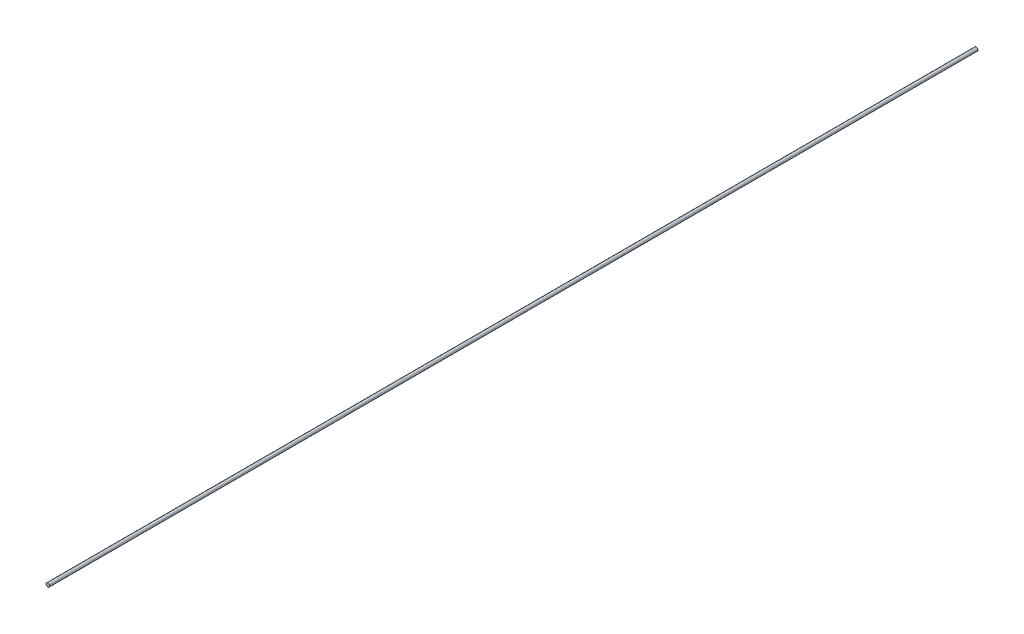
ISO-10303-21;
HEADER;
FILE_DESCRIPTION(('STEP AP214'),'2;1');
FILE_NAME('part.step','',(''),(''),'','','');
FILE_SCHEMA(('AUTOMOTIVE_DESIGN { 1 0 10303 214 1 1 1 1 }'));
ENDSEC;
DATA;
#1=APPLICATION_CONTEXT('core data for automotive mechanical design processes');
#2=APPLICATION_PROTOCOL_DEFINITION('international standard','automotive_design',2000,#1);
#3=PRODUCT_CONTEXT('',#1,'mechanical');
#4=PRODUCT('Part','Part','',(#3));
#5=PRODUCT_RELATED_PRODUCT_CATEGORY('part','',(#4));
#6=PRODUCT_DEFINITION_FORMATION('','',#4);
#7=PRODUCT_DEFINITION_CONTEXT('part definition',#1,'design');
#8=PRODUCT_DEFINITION('design','',#6,#7);
#9=PRODUCT_DEFINITION_SHAPE('','',#8);
#10=(LENGTH_UNIT() NAMED_UNIT(*) SI_UNIT(.MILLI.,.METRE.));
#11=(NAMED_UNIT(*) PLANE_ANGLE_UNIT() SI_UNIT($,.RADIAN.));
#12=(NAMED_UNIT(*) SI_UNIT($,.STERADIAN.) SOLID_ANGLE_UNIT());
#13=UNCERTAINTY_MEASURE_WITH_UNIT(LENGTH_MEASURE(1.E-05),#10,'distance_accuracy_value','');
#14=(GEOMETRIC_REPRESENTATION_CONTEXT(3) GLOBAL_UNCERTAINTY_ASSIGNED_CONTEXT((#13)) GLOBAL_UNIT_ASSIGNED_CONTEXT((#10,
#11,#12)) REPRESENTATION_CONTEXT('',''));
#15=CARTESIAN_POINT('',(0.,0.,0.));
#16=DIRECTION('',(0.,0.,1.));
#17=DIRECTION('',(1.,0.,0.));
#18=AXIS2_PLACEMENT_3D('',#15,#16,#17);
#19=CARTESIAN_POINT('',(0.,0.,0.));
#20=DIRECTION('',(0.,0.,1.));
#21=DIRECTION('',(1.,0.,0.));
#22=AXIS2_PLACEMENT_3D('',#19,#20,#21);
#23=PLANE('',#22);
#24=CARTESIAN_POINT('',(0.,0.,0.));
#25=DIRECTION('',(0.,0.,1.));
#26=DIRECTION('',(1.,0.,0.));
#27=AXIS2_PLACEMENT_3D('',#24,#25,#26);
#28=CIRCLE('',#27,5.);
#29=CARTESIAN_POINT('',(5.,0.,0.));
#30=VERTEX_POINT('',#29);
#31=EDGE_CURVE('E44',#30,#30,#28,.T.);
#32=ORIENTED_EDGE('',*,*,#31,.F.);
#33=EDGE_LOOP('',(#32));
#34=FACE_BOUND('',#33,.T.);
#35=ADVANCED_FACE('F37',(#34),#23,.F.);
#36=CARTESIAN_POINT('',(0.,-3.19087846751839E-13,2605.55));
#37=DIRECTION('',(0.,0.,1.));
#38=DIRECTION('',(1.,0.,0.));
#39=AXIS2_PLACEMENT_3D('',#36,#37,#38);
#40=PLANE('',#39);
#41=CARTESIAN_POINT('',(0.,-3.19087846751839E-13,2605.55));
#42=DIRECTION('',(0.,0.,1.));
#43=DIRECTION('',(1.,0.,0.));
#44=AXIS2_PLACEMENT_3D('',#41,#42,#43);
#45=CIRCLE('',#44,5.);
#46=CARTESIAN_POINT('',(5.,-3.19087846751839E-13,2605.55));
#47=VERTEX_POINT('',#46);
#48=EDGE_CURVE('E10',#47,#47,#45,.T.);
#49=ORIENTED_EDGE('',*,*,#48,.T.);
#50=EDGE_LOOP('',(#49));
#51=FACE_BOUND('',#50,.T.);
#52=ADVANCED_FACE('F54',(#51),#40,.T.);
#53=CARTESIAN_POINT('',(0.,0.,0.));
#54=DIRECTION('',(0.,0.,1.));
#55=DIRECTION('',(0.,-1.,0.));
#56=AXIS2_PLACEMENT_3D('',#53,#54,#55);
#57=CYLINDRICAL_SURFACE('',#56,5.);
#58=ORIENTED_EDGE('',*,*,#48,.F.);
#59=EDGE_LOOP('',(#58));
#60=FACE_BOUND('',#59,.T.);
#61=ORIENTED_EDGE('',*,*,#31,.T.);
#62=EDGE_LOOP('',(#61));
#63=FACE_BOUND('',#62,.T.);
#64=ADVANCED_FACE('F51',(#60,#63),#57,.T.);
#65=CLOSED_SHELL('',(#35,#52,#64));
#66=MANIFOLD_SOLID_BREP('B2',#65);
#67=ADVANCED_BREP_SHAPE_REPRESENTATION('',(#18,#66),#14);
#68=SHAPE_DEFINITION_REPRESENTATION(#9,#67);
ENDSEC;
END-ISO-10303-21;
